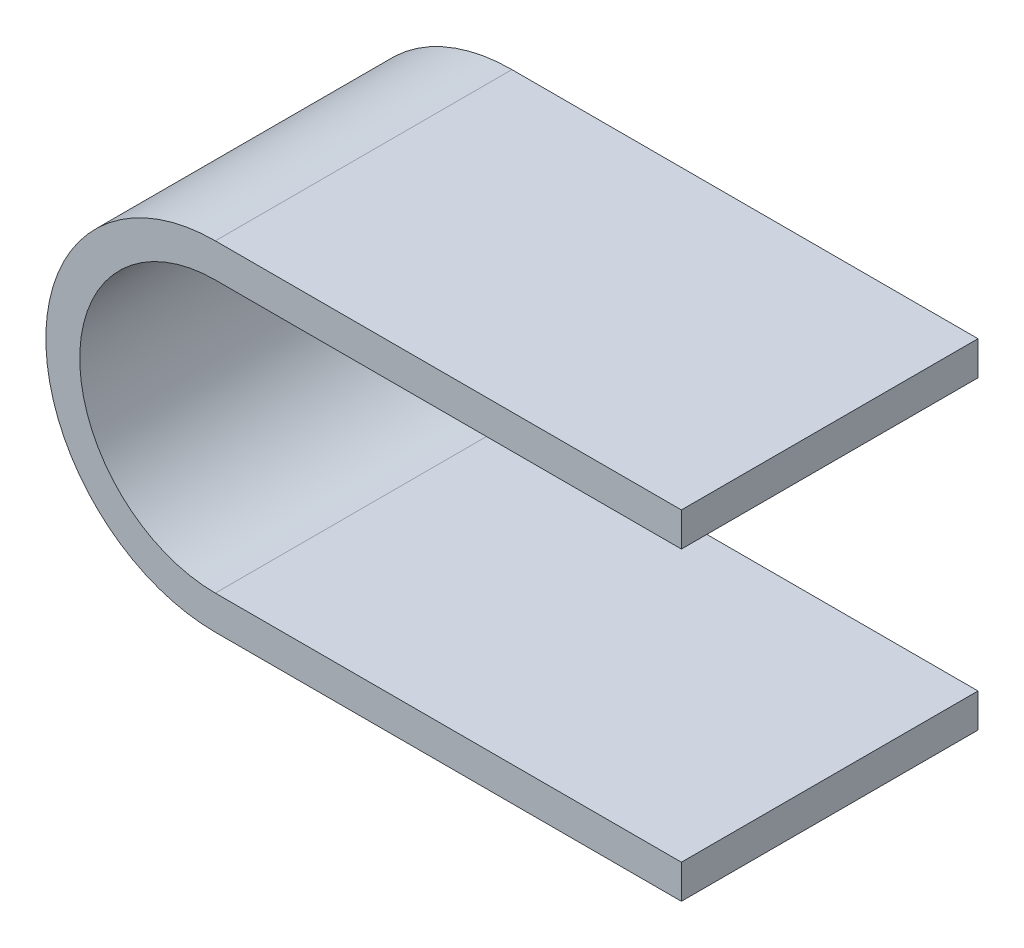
ISO-10303-21;
HEADER;
FILE_DESCRIPTION(('STEP AP214'),'2;1');
FILE_NAME('part.step','',(''),(''),'','','');
FILE_SCHEMA(('AUTOMOTIVE_DESIGN { 1 0 10303 214 1 1 1 1 }'));
ENDSEC;
DATA;
#1=APPLICATION_CONTEXT('core data for automotive mechanical design processes');
#2=APPLICATION_PROTOCOL_DEFINITION('international standard','automotive_design',2000,#1);
#3=PRODUCT_CONTEXT('',#1,'mechanical');
#4=PRODUCT('Part','Part','',(#3));
#5=PRODUCT_RELATED_PRODUCT_CATEGORY('part','',(#4));
#6=PRODUCT_DEFINITION_FORMATION('','',#4);
#7=PRODUCT_DEFINITION_CONTEXT('part definition',#1,'design');
#8=PRODUCT_DEFINITION('design','',#6,#7);
#9=PRODUCT_DEFINITION_SHAPE('','',#8);
#10=(LENGTH_UNIT() NAMED_UNIT(*) SI_UNIT(.MILLI.,.METRE.));
#11=(NAMED_UNIT(*) PLANE_ANGLE_UNIT() SI_UNIT($,.RADIAN.));
#12=(NAMED_UNIT(*) SI_UNIT($,.STERADIAN.) SOLID_ANGLE_UNIT());
#13=UNCERTAINTY_MEASURE_WITH_UNIT(LENGTH_MEASURE(1.E-05),#10,'distance_accuracy_value','');
#14=(GEOMETRIC_REPRESENTATION_CONTEXT(3) GLOBAL_UNCERTAINTY_ASSIGNED_CONTEXT((#13)) GLOBAL_UNIT_ASSIGNED_CONTEXT((#10,
#11,#12)) REPRESENTATION_CONTEXT('',''));
#15=CARTESIAN_POINT('',(0.,0.,0.));
#16=DIRECTION('',(0.,0.,1.));
#17=DIRECTION('',(1.,0.,0.));
#18=AXIS2_PLACEMENT_3D('',#15,#16,#17);
#19=CARTESIAN_POINT('',(0.,0.,35.));
#20=DIRECTION('',(-1.,0.,0.));
#21=DIRECTION('',(0.,0.,1.));
#22=AXIS2_PLACEMENT_3D('',#19,#20,#21);
#23=PLANE('',#22);
#24=DIRECTION('',(0.,1.,0.));
#25=VECTOR('',#24,1.);
#26=CARTESIAN_POINT('',(0.,0.,0.));
#27=LINE('',#26,#25);
#28=CARTESIAN_POINT('',(0.,-4.,0.));
#29=VERTEX_POINT('',#28);
#30=CARTESIAN_POINT('',(0.,0.,0.));
#31=VERTEX_POINT('',#30);
#32=EDGE_CURVE('E129',#29,#31,#27,.T.);
#33=ORIENTED_EDGE('',*,*,#32,.T.);
#34=DIRECTION('',(0.,0.,-1.));
#35=VECTOR('',#34,1.);
#36=CARTESIAN_POINT('',(0.,0.,35.));
#37=LINE('',#36,#35);
#38=CARTESIAN_POINT('',(0.,0.,35.));
#39=VERTEX_POINT('',#38);
#40=EDGE_CURVE('E11',#39,#31,#37,.T.);
#41=ORIENTED_EDGE('',*,*,#40,.F.);
#42=DIRECTION('',(0.,1.,0.));
#43=VECTOR('',#42,1.);
#44=CARTESIAN_POINT('',(0.,0.,35.));
#45=LINE('',#44,#43);
#46=CARTESIAN_POINT('',(0.,-4.,35.));
#47=VERTEX_POINT('',#46);
#48=EDGE_CURVE('E143',#47,#39,#45,.T.);
#49=ORIENTED_EDGE('',*,*,#48,.F.);
#50=DIRECTION('',(0.,0.,-1.));
#51=VECTOR('',#50,1.);
#52=CARTESIAN_POINT('',(0.,-4.,35.));
#53=LINE('',#52,#51);
#54=EDGE_CURVE('E125',#47,#29,#53,.T.);
#55=ORIENTED_EDGE('',*,*,#54,.T.);
#56=EDGE_LOOP('',(#33,#41,#49,#55));
#57=FACE_BOUND('',#56,.T.);
#58=ADVANCED_FACE('F33',(#57),#23,.F.);
#59=CARTESIAN_POINT('',(0.,0.,35.));
#60=DIRECTION('',(0.,-1.,0.));
#61=DIRECTION('',(1.,0.,0.));
#62=AXIS2_PLACEMENT_3D('',#59,#60,#61);
#63=PLANE('',#62);
#64=DIRECTION('',(-1.,0.,0.));
#65=VECTOR('',#64,1.);
#66=CARTESIAN_POINT('',(0.,0.,0.));
#67=LINE('',#66,#65);
#68=CARTESIAN_POINT('',(-55.,0.,0.));
#69=VERTEX_POINT('',#68);
#70=EDGE_CURVE('E132',#31,#69,#67,.T.);
#71=ORIENTED_EDGE('',*,*,#70,.T.);
#72=DIRECTION('',(0.,0.,-1.));
#73=VECTOR('',#72,1.);
#74=CARTESIAN_POINT('',(-55.,0.,35.));
#75=LINE('',#74,#73);
#76=CARTESIAN_POINT('',(-55.,0.,35.));
#77=VERTEX_POINT('',#76);
#78=EDGE_CURVE('E41',#77,#69,#75,.T.);
#79=ORIENTED_EDGE('',*,*,#78,.F.);
#80=DIRECTION('',(-1.,0.,0.));
#81=VECTOR('',#80,1.);
#82=CARTESIAN_POINT('',(0.,0.,35.));
#83=LINE('',#82,#81);
#84=EDGE_CURVE('E92',#39,#77,#83,.T.);
#85=ORIENTED_EDGE('',*,*,#84,.F.);
#86=ORIENTED_EDGE('',*,*,#40,.T.);
#87=EDGE_LOOP('',(#71,#79,#85,#86));
#88=FACE_BOUND('',#87,.T.);
#89=ADVANCED_FACE('F178',(#88),#63,.F.);
#90=CARTESIAN_POINT('',(-55.,16.,35.));
#91=DIRECTION('',(0.,0.,-1.));
#92=DIRECTION('',(-1.,0.,0.));
#93=AXIS2_PLACEMENT_3D('',#90,#91,#92);
#94=CYLINDRICAL_SURFACE('',#93,16.);
#95=CARTESIAN_POINT('',(-55.,16.,0.));
#96=DIRECTION('',(0.,0.,-1.));
#97=DIRECTION('',(-1.,0.,0.));
#98=AXIS2_PLACEMENT_3D('',#95,#96,#97);
#99=CIRCLE('',#98,16.);
#100=CARTESIAN_POINT('',(-55.,32.,0.));
#101=VERTEX_POINT('',#100);
#102=EDGE_CURVE('E134',#69,#101,#99,.T.);
#103=ORIENTED_EDGE('',*,*,#102,.T.);
#104=DIRECTION('',(0.,0.,-1.));
#105=VECTOR('',#104,1.);
#106=CARTESIAN_POINT('',(-55.,32.,35.));
#107=LINE('',#106,#105);
#108=CARTESIAN_POINT('',(-55.,32.,35.));
#109=VERTEX_POINT('',#108);
#110=EDGE_CURVE('E150',#109,#101,#107,.T.);
#111=ORIENTED_EDGE('',*,*,#110,.F.);
#112=CARTESIAN_POINT('',(-55.,16.,35.));
#113=DIRECTION('',(0.,0.,-1.));
#114=DIRECTION('',(-1.,0.,0.));
#115=AXIS2_PLACEMENT_3D('',#112,#113,#114);
#116=CIRCLE('',#115,16.);
#117=EDGE_CURVE('E158',#77,#109,#116,.T.);
#118=ORIENTED_EDGE('',*,*,#117,.F.);
#119=ORIENTED_EDGE('',*,*,#78,.T.);
#120=EDGE_LOOP('',(#103,#111,#118,#119));
#121=FACE_BOUND('',#120,.T.);
#122=ADVANCED_FACE('F156',(#121),#94,.F.);
#123=CARTESIAN_POINT('',(0.,32.,35.));
#124=DIRECTION('',(0.,1.,0.));
#125=DIRECTION('',(-1.,0.,0.));
#126=AXIS2_PLACEMENT_3D('',#123,#124,#125);
#127=PLANE('',#126);
#128=DIRECTION('',(1.,0.,0.));
#129=VECTOR('',#128,1.);
#130=CARTESIAN_POINT('',(0.,32.,0.));
#131=LINE('',#130,#129);
#132=CARTESIAN_POINT('',(0.,32.,0.));
#133=VERTEX_POINT('',#132);
#134=EDGE_CURVE('E136',#101,#133,#131,.T.);
#135=ORIENTED_EDGE('',*,*,#134,.T.);
#136=DIRECTION('',(0.,0.,-1.));
#137=VECTOR('',#136,1.);
#138=CARTESIAN_POINT('',(0.,32.,35.));
#139=LINE('',#138,#137);
#140=CARTESIAN_POINT('',(0.,32.,35.));
#141=VERTEX_POINT('',#140);
#142=EDGE_CURVE('E147',#141,#133,#139,.T.);
#143=ORIENTED_EDGE('',*,*,#142,.F.);
#144=DIRECTION('',(1.,0.,0.));
#145=VECTOR('',#144,1.);
#146=CARTESIAN_POINT('',(0.,32.,35.));
#147=LINE('',#146,#145);
#148=EDGE_CURVE('E170',#109,#141,#147,.T.);
#149=ORIENTED_EDGE('',*,*,#148,.F.);
#150=ORIENTED_EDGE('',*,*,#110,.T.);
#151=EDGE_LOOP('',(#135,#143,#149,#150));
#152=FACE_BOUND('',#151,.T.);
#153=ADVANCED_FACE('F166',(#152),#127,.F.);
#154=CARTESIAN_POINT('',(0.,36.,35.));
#155=DIRECTION('',(-1.,0.,0.));
#156=DIRECTION('',(0.,0.,1.));
#157=AXIS2_PLACEMENT_3D('',#154,#155,#156);
#158=PLANE('',#157);
#159=DIRECTION('',(0.,1.,0.));
#160=VECTOR('',#159,1.);
#161=CARTESIAN_POINT('',(0.,36.,0.));
#162=LINE('',#161,#160);
#163=CARTESIAN_POINT('',(0.,36.,0.));
#164=VERTEX_POINT('',#163);
#165=EDGE_CURVE('E138',#133,#164,#162,.T.);
#166=ORIENTED_EDGE('',*,*,#165,.T.);
#167=DIRECTION('',(0.,0.,-1.));
#168=VECTOR('',#167,1.);
#169=CARTESIAN_POINT('',(0.,36.,35.));
#170=LINE('',#169,#168);
#171=CARTESIAN_POINT('',(0.,36.,35.));
#172=VERTEX_POINT('',#171);
#173=EDGE_CURVE('E120',#172,#164,#170,.T.);
#174=ORIENTED_EDGE('',*,*,#173,.F.);
#175=DIRECTION('',(0.,1.,0.));
#176=VECTOR('',#175,1.);
#177=CARTESIAN_POINT('',(0.,36.,35.));
#178=LINE('',#177,#176);
#179=EDGE_CURVE('E111',#141,#172,#178,.T.);
#180=ORIENTED_EDGE('',*,*,#179,.F.);
#181=ORIENTED_EDGE('',*,*,#142,.T.);
#182=EDGE_LOOP('',(#166,#174,#180,#181));
#183=FACE_BOUND('',#182,.T.);
#184=ADVANCED_FACE('F169',(#183),#158,.F.);
#185=CARTESIAN_POINT('',(0.,36.,35.));
#186=DIRECTION('',(0.,-1.,0.));
#187=DIRECTION('',(1.,0.,0.));
#188=AXIS2_PLACEMENT_3D('',#185,#186,#187);
#189=PLANE('',#188);
#190=DIRECTION('',(-1.,0.,0.));
#191=VECTOR('',#190,1.);
#192=CARTESIAN_POINT('',(0.,36.,0.));
#193=LINE('',#192,#191);
#194=CARTESIAN_POINT('',(-55.,36.,0.));
#195=VERTEX_POINT('',#194);
#196=EDGE_CURVE('E119',#164,#195,#193,.T.);
#197=ORIENTED_EDGE('',*,*,#196,.T.);
#198=DIRECTION('',(0.,0.,-1.));
#199=VECTOR('',#198,1.);
#200=CARTESIAN_POINT('',(-55.,36.,35.));
#201=LINE('',#200,#199);
#202=CARTESIAN_POINT('',(-55.,36.,35.));
#203=VERTEX_POINT('',#202);
#204=EDGE_CURVE('E116',#203,#195,#201,.T.);
#205=ORIENTED_EDGE('',*,*,#204,.F.);
#206=DIRECTION('',(-1.,0.,0.));
#207=VECTOR('',#206,1.);
#208=CARTESIAN_POINT('',(0.,36.,35.));
#209=LINE('',#208,#207);
#210=EDGE_CURVE('E105',#172,#203,#209,.T.);
#211=ORIENTED_EDGE('',*,*,#210,.F.);
#212=ORIENTED_EDGE('',*,*,#173,.T.);
#213=EDGE_LOOP('',(#197,#205,#211,#212));
#214=FACE_BOUND('',#213,.T.);
#215=ADVANCED_FACE('F117',(#214),#189,.F.);
#216=CARTESIAN_POINT('',(-55.,16.,35.));
#217=DIRECTION('',(0.,0.,-1.));
#218=DIRECTION('',(-1.,0.,0.));
#219=AXIS2_PLACEMENT_3D('',#216,#217,#218);
#220=CYLINDRICAL_SURFACE('',#219,20.);
#221=CARTESIAN_POINT('',(-55.,16.,0.));
#222=DIRECTION('',(0.,0.,1.));
#223=DIRECTION('',(-1.,0.,0.));
#224=AXIS2_PLACEMENT_3D('',#221,#222,#223);
#225=CIRCLE('',#224,20.);
#226=CARTESIAN_POINT('',(-55.,-4.,0.));
#227=VERTEX_POINT('',#226);
#228=EDGE_CURVE('E78',#195,#227,#225,.T.);
#229=ORIENTED_EDGE('',*,*,#228,.T.);
#230=DIRECTION('',(0.,0.,-1.));
#231=VECTOR('',#230,1.);
#232=CARTESIAN_POINT('',(-55.,-4.,35.));
#233=LINE('',#232,#231);
#234=CARTESIAN_POINT('',(-55.,-4.,35.));
#235=VERTEX_POINT('',#234);
#236=EDGE_CURVE('E121',#235,#227,#233,.T.);
#237=ORIENTED_EDGE('',*,*,#236,.F.);
#238=CARTESIAN_POINT('',(-55.,16.,35.));
#239=DIRECTION('',(0.,0.,1.));
#240=DIRECTION('',(-1.,0.,0.));
#241=AXIS2_PLACEMENT_3D('',#238,#239,#240);
#242=CIRCLE('',#241,20.);
#243=EDGE_CURVE('E109',#203,#235,#242,.T.);
#244=ORIENTED_EDGE('',*,*,#243,.F.);
#245=ORIENTED_EDGE('',*,*,#204,.T.);
#246=EDGE_LOOP('',(#229,#237,#244,#245));
#247=FACE_BOUND('',#246,.T.);
#248=ADVANCED_FACE('F123',(#247),#220,.T.);
#249=CARTESIAN_POINT('',(0.,-4.,35.));
#250=DIRECTION('',(0.,1.,0.));
#251=DIRECTION('',(0.,0.,1.));
#252=AXIS2_PLACEMENT_3D('',#249,#250,#251);
#253=PLANE('',#252);
#254=DIRECTION('',(1.,0.,0.));
#255=VECTOR('',#254,1.);
#256=CARTESIAN_POINT('',(0.,-4.,0.));
#257=LINE('',#256,#255);
#258=EDGE_CURVE('E84',#227,#29,#257,.T.);
#259=ORIENTED_EDGE('',*,*,#258,.T.);
#260=ORIENTED_EDGE('',*,*,#54,.F.);
#261=DIRECTION('',(1.,0.,0.));
#262=VECTOR('',#261,1.);
#263=CARTESIAN_POINT('',(0.,-4.,35.));
#264=LINE('',#263,#262);
#265=EDGE_CURVE('E49',#235,#47,#264,.T.);
#266=ORIENTED_EDGE('',*,*,#265,.F.);
#267=ORIENTED_EDGE('',*,*,#236,.T.);
#268=EDGE_LOOP('',(#259,#260,#266,#267));
#269=FACE_BOUND('',#268,.T.);
#270=ADVANCED_FACE('F194',(#269),#253,.F.);
#271=CARTESIAN_POINT('',(-55.,16.,35.));
#272=DIRECTION('',(0.,0.,-1.));
#273=DIRECTION('',(-1.,0.,0.));
#274=AXIS2_PLACEMENT_3D('',#271,#272,#273);
#275=PLANE('',#274);
#276=ORIENTED_EDGE('',*,*,#48,.T.);
#277=ORIENTED_EDGE('',*,*,#84,.T.);
#278=ORIENTED_EDGE('',*,*,#117,.T.);
#279=ORIENTED_EDGE('',*,*,#148,.T.);
#280=ORIENTED_EDGE('',*,*,#179,.T.);
#281=ORIENTED_EDGE('',*,*,#210,.T.);
#282=ORIENTED_EDGE('',*,*,#243,.T.);
#283=ORIENTED_EDGE('',*,*,#265,.T.);
#284=EDGE_LOOP('',(#276,#277,#278,#279,#280,#281,#282,#283));
#285=FACE_BOUND('',#284,.T.);
#286=ADVANCED_FACE('F107',(#285),#275,.F.);
#287=CARTESIAN_POINT('',(-55.,16.,0.));
#288=DIRECTION('',(0.,0.,-1.));
#289=DIRECTION('',(-1.,0.,0.));
#290=AXIS2_PLACEMENT_3D('',#287,#288,#289);
#291=PLANE('',#290);
#292=ORIENTED_EDGE('',*,*,#32,.F.);
#293=ORIENTED_EDGE('',*,*,#258,.F.);
#294=ORIENTED_EDGE('',*,*,#228,.F.);
#295=ORIENTED_EDGE('',*,*,#196,.F.);
#296=ORIENTED_EDGE('',*,*,#165,.F.);
#297=ORIENTED_EDGE('',*,*,#134,.F.);
#298=ORIENTED_EDGE('',*,*,#102,.F.);
#299=ORIENTED_EDGE('',*,*,#70,.F.);
#300=EDGE_LOOP('',(#292,#293,#294,#295,#296,#297,#298,#299));
#301=FACE_BOUND('',#300,.T.);
#302=ADVANCED_FACE('F162',(#301),#291,.T.);
#303=CLOSED_SHELL('',(#58,#89,#122,#153,#184,#215,#248,#270,#286,#302));
#304=MANIFOLD_SOLID_BREP('B2',#303);
#305=ADVANCED_BREP_SHAPE_REPRESENTATION('',(#18,#304),#14);
#306=SHAPE_DEFINITION_REPRESENTATION(#9,#305);
ENDSEC;
END-ISO-10303-21;
